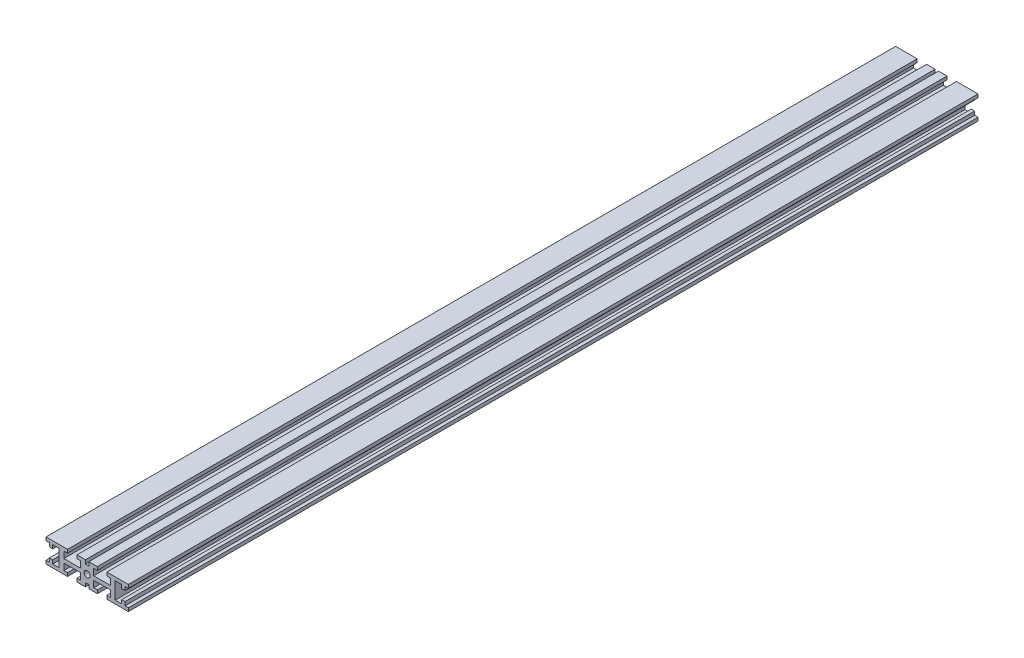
from build123d import *

# Parameters (mm, degrees)
BOSS_EXTRUDE1_DEPTH = 458.6
M4_TAPPED_HOLE1_D   = 3.3
SKETCH5_W           = 1.8
SKETCH5_H           = 2
CUT_EXTRUDE1_DEPTH  = 460.182135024


with BuildPart() as part:
    # Sketch1 → Boss-Extrude1 (new body)
    with BuildSketch(Plane.XY):
        Polygon((5.5, 6.35), (-5.5, 6.35), (-5.5, 4.55), (-3.5, 4.55), (-3.5, 1.05), (-12.6, 1.05), (-12.6, 4.55), (-10.6, 4.55), (-10.6, 6.35), (-22.225, 6.35), (-22.225, 4.55), (-20.425, 4.55), (-20.425, 2.55), (-18.625, 2.55), (-18.625, 4.55), (-15.125, 4.55), (-15.125, -4.55), (-18.625, -4.55), (-18.625, -2.55), (-20.425, -2.55), (-20.425, -4.55), (-22.225, -4.55), (-22.225, -6.35), (-10.6, -6.35), (-10.6, -4.55), (-12.6, -4.55), (-12.6, -1.05), (-3.5, -1.05), (-3.5, -4.55), (-5.5, -4.55), (-5.5, -6.35), (5.5, -6.35), (5.5, -4.55), (3.5, -4.55), (3.5, -1.05), (12.6, -1.05), (12.6, -4.55), (10.6, -4.55), (10.6, -6.35), (22.225, -6.35), (22.225, -4.55), (20.425, -4.55), (20.425, -2.55), (18.625, -2.55), (18.625, -4.55), (15.125, -4.55), (15.125, 4.55), (18.625, 4.55), (18.625, 2.55), (20.425, 2.55), (20.425, 4.55), (22.225, 4.55), (22.225, 6.35), (10.6, 6.35), (10.6, 4.55), (12.6, 4.55), (12.6, 1.05), (3.5, 1.05), (3.5, 4.55), (5.5, 4.55), align=None)
    extrude(amount=BOSS_EXTRUDE1_DEPTH)

    # M4 Tapped Hole1 (through all)
    with Locations(Plane.XY.offset(458.6)):
        with Locations((0, 0)):
            Hole(M4_TAPPED_HOLE1_D / 2)

    # Sketch5 → Cut-Extrude1 (cut, through all)
    with BuildSketch(Plane.XY.offset(458.6)):
        with Locations((0, -5.35)):
            Rectangle(SKETCH5_W, SKETCH5_H)
        with Locations((0, 5.35)):
            Rectangle(SKETCH5_W, SKETCH5_H)
    extrude(amount=-CUT_EXTRUDE1_DEPTH, mode=Mode.SUBTRACT)


solid = part.part
